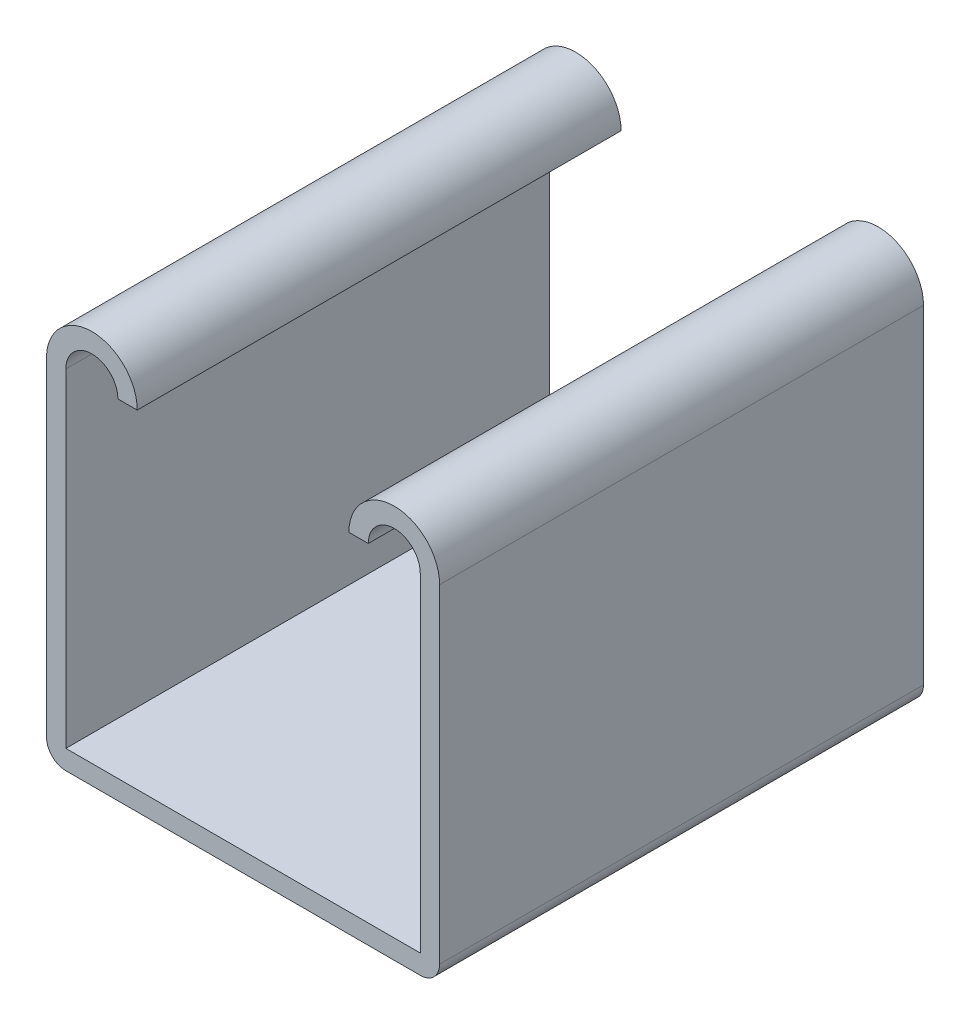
ISO-10303-21;
HEADER;
FILE_DESCRIPTION(('STEP AP214'),'2;1');
FILE_NAME('part.step','',(''),(''),'','','');
FILE_SCHEMA(('AUTOMOTIVE_DESIGN { 1 0 10303 214 1 1 1 1 }'));
ENDSEC;
DATA;
#1=APPLICATION_CONTEXT('core data for automotive mechanical design processes');
#2=APPLICATION_PROTOCOL_DEFINITION('international standard','automotive_design',2000,#1);
#3=PRODUCT_CONTEXT('',#1,'mechanical');
#4=PRODUCT('Part','Part','',(#3));
#5=PRODUCT_RELATED_PRODUCT_CATEGORY('part','',(#4));
#6=PRODUCT_DEFINITION_FORMATION('','',#4);
#7=PRODUCT_DEFINITION_CONTEXT('part definition',#1,'design');
#8=PRODUCT_DEFINITION('design','',#6,#7);
#9=PRODUCT_DEFINITION_SHAPE('','',#8);
#10=(LENGTH_UNIT() NAMED_UNIT(*) SI_UNIT(.MILLI.,.METRE.));
#11=(NAMED_UNIT(*) PLANE_ANGLE_UNIT() SI_UNIT($,.RADIAN.));
#12=(NAMED_UNIT(*) SI_UNIT($,.STERADIAN.) SOLID_ANGLE_UNIT());
#13=UNCERTAINTY_MEASURE_WITH_UNIT(LENGTH_MEASURE(1.E-05),#10,'distance_accuracy_value','');
#14=(GEOMETRIC_REPRESENTATION_CONTEXT(3) GLOBAL_UNCERTAINTY_ASSIGNED_CONTEXT((#13)) GLOBAL_UNIT_ASSIGNED_CONTEXT((#10,
#11,#12)) REPRESENTATION_CONTEXT('',''));
#15=CARTESIAN_POINT('',(0.,0.,0.));
#16=DIRECTION('',(0.,0.,1.));
#17=DIRECTION('',(1.,0.,0.));
#18=AXIS2_PLACEMENT_3D('',#15,#16,#17);
#19=CARTESIAN_POINT('',(-7.9375,9.37895,12.7));
#20=DIRECTION('',(0.,0.,-1.));
#21=DIRECTION('',(-1.,0.,0.));
#22=AXIS2_PLACEMENT_3D('',#19,#20,#21);
#23=CYLINDRICAL_SURFACE('',#22,2.38125);
#24=CARTESIAN_POINT('',(-7.9375,9.37895,-12.7));
#25=DIRECTION('',(0.,0.,1.));
#26=DIRECTION('',(-1.,0.,0.));
#27=AXIS2_PLACEMENT_3D('',#24,#25,#26);
#28=CIRCLE('',#27,2.38125);
#29=CARTESIAN_POINT('',(-5.55625,9.37895,-12.7));
#30=VERTEX_POINT('',#29);
#31=CARTESIAN_POINT('',(-10.31875,9.37895,-12.7));
#32=VERTEX_POINT('',#31);
#33=EDGE_CURVE('E164',#30,#32,#28,.T.);
#34=ORIENTED_EDGE('',*,*,#33,.T.);
#35=DIRECTION('',(0.,0.,-1.));
#36=VECTOR('',#35,1.);
#37=CARTESIAN_POINT('',(-10.31875,9.37895,12.7));
#38=LINE('',#37,#36);
#39=CARTESIAN_POINT('',(-10.31875,9.37895,12.7));
#40=VERTEX_POINT('',#39);
#41=EDGE_CURVE('E11',#40,#32,#38,.T.);
#42=ORIENTED_EDGE('',*,*,#41,.F.);
#43=CARTESIAN_POINT('',(-7.9375,9.37895,12.7));
#44=DIRECTION('',(0.,0.,1.));
#45=DIRECTION('',(-1.,0.,0.));
#46=AXIS2_PLACEMENT_3D('',#43,#44,#45);
#47=CIRCLE('',#46,2.38125);
#48=CARTESIAN_POINT('',(-5.55625,9.37895,12.7));
#49=VERTEX_POINT('',#48);
#50=EDGE_CURVE('E190',#49,#40,#47,.T.);
#51=ORIENTED_EDGE('',*,*,#50,.F.);
#52=DIRECTION('',(0.,0.,-1.));
#53=VECTOR('',#52,1.);
#54=CARTESIAN_POINT('',(-5.55625,9.37895,12.7));
#55=LINE('',#54,#53);
#56=EDGE_CURVE('E160',#49,#30,#55,.T.);
#57=ORIENTED_EDGE('',*,*,#56,.T.);
#58=EDGE_LOOP('',(#34,#42,#51,#57));
#59=FACE_BOUND('',#58,.T.);
#60=ADVANCED_FACE('F32',(#59),#23,.T.);
#61=CARTESIAN_POINT('',(-10.31875,9.37895,12.7));
#62=DIRECTION('',(1.,0.,0.));
#63=DIRECTION('',(0.,1.,0.));
#64=AXIS2_PLACEMENT_3D('',#61,#62,#63);
#65=PLANE('',#64);
#66=DIRECTION('',(0.,-1.,0.));
#67=VECTOR('',#66,1.);
#68=CARTESIAN_POINT('',(-10.31875,9.37895,-12.7));
#69=LINE('',#68,#67);
#70=CARTESIAN_POINT('',(-10.31875,-7.874,-12.7));
#71=VERTEX_POINT('',#70);
#72=EDGE_CURVE('E167',#32,#71,#69,.T.);
#73=ORIENTED_EDGE('',*,*,#72,.T.);
#74=DIRECTION('',(0.,0.,-1.));
#75=VECTOR('',#74,1.);
#76=CARTESIAN_POINT('',(-10.31875,-7.874,12.7));
#77=LINE('',#76,#75);
#78=CARTESIAN_POINT('',(-10.31875,-7.874,12.7));
#79=VERTEX_POINT('',#78);
#80=EDGE_CURVE('E40',#79,#71,#77,.T.);
#81=ORIENTED_EDGE('',*,*,#80,.F.);
#82=DIRECTION('',(0.,-1.,0.));
#83=VECTOR('',#82,1.);
#84=CARTESIAN_POINT('',(-10.31875,9.37895,12.7));
#85=LINE('',#84,#83);
#86=EDGE_CURVE('E109',#40,#79,#85,.T.);
#87=ORIENTED_EDGE('',*,*,#86,.F.);
#88=ORIENTED_EDGE('',*,*,#41,.T.);
#89=EDGE_LOOP('',(#73,#81,#87,#88));
#90=FACE_BOUND('',#89,.T.);
#91=ADVANCED_FACE('F278',(#90),#65,.F.);
#92=CARTESIAN_POINT('',(-9.30275,-7.874,12.7));
#93=DIRECTION('',(0.,0.,-1.));
#94=DIRECTION('',(-1.,0.,0.));
#95=AXIS2_PLACEMENT_3D('',#92,#93,#94);
#96=CYLINDRICAL_SURFACE('',#95,1.016);
#97=CARTESIAN_POINT('',(-9.30275,-7.874,-12.7));
#98=DIRECTION('',(0.,0.,1.));
#99=DIRECTION('',(-1.,0.,0.));
#100=AXIS2_PLACEMENT_3D('',#97,#98,#99);
#101=CIRCLE('',#100,1.016);
#102=CARTESIAN_POINT('',(-9.30275,-8.89,-12.7));
#103=VERTEX_POINT('',#102);
#104=EDGE_CURVE('E169',#71,#103,#101,.T.);
#105=ORIENTED_EDGE('',*,*,#104,.T.);
#106=DIRECTION('',(0.,0.,-1.));
#107=VECTOR('',#106,1.);
#108=CARTESIAN_POINT('',(-9.30275,-8.89,12.7));
#109=LINE('',#108,#107);
#110=CARTESIAN_POINT('',(-9.30275,-8.89,12.7));
#111=VERTEX_POINT('',#110);
#112=EDGE_CURVE('E215',#111,#103,#109,.T.);
#113=ORIENTED_EDGE('',*,*,#112,.F.);
#114=CARTESIAN_POINT('',(-9.30275,-7.874,12.7));
#115=DIRECTION('',(0.,0.,1.));
#116=DIRECTION('',(-1.,0.,0.));
#117=AXIS2_PLACEMENT_3D('',#114,#115,#116);
#118=CIRCLE('',#117,1.016);
#119=EDGE_CURVE('E223',#79,#111,#118,.T.);
#120=ORIENTED_EDGE('',*,*,#119,.F.);
#121=ORIENTED_EDGE('',*,*,#80,.T.);
#122=EDGE_LOOP('',(#105,#113,#120,#121));
#123=FACE_BOUND('',#122,.T.);
#124=ADVANCED_FACE('F221',(#123),#96,.T.);
#125=CARTESIAN_POINT('',(-9.30275,-8.89,12.7));
#126=DIRECTION('',(0.,1.,0.));
#127=DIRECTION('',(0.,0.,1.));
#128=AXIS2_PLACEMENT_3D('',#125,#126,#127);
#129=PLANE('',#128);
#130=DIRECTION('',(1.,0.,0.));
#131=VECTOR('',#130,1.);
#132=CARTESIAN_POINT('',(-9.30275,-8.89,-12.7));
#133=LINE('',#132,#131);
#134=CARTESIAN_POINT('',(9.30275,-8.89,-12.7));
#135=VERTEX_POINT('',#134);
#136=EDGE_CURVE('E171',#103,#135,#133,.T.);
#137=ORIENTED_EDGE('',*,*,#136,.T.);
#138=DIRECTION('',(0.,0.,-1.));
#139=VECTOR('',#138,1.);
#140=CARTESIAN_POINT('',(9.30275,-8.89,12.7));
#141=LINE('',#140,#139);
#142=CARTESIAN_POINT('',(9.30275,-8.89,12.7));
#143=VERTEX_POINT('',#142);
#144=EDGE_CURVE('E212',#143,#135,#141,.T.);
#145=ORIENTED_EDGE('',*,*,#144,.F.);
#146=DIRECTION('',(1.,0.,0.));
#147=VECTOR('',#146,1.);
#148=CARTESIAN_POINT('',(-9.30275,-8.89,12.7));
#149=LINE('',#148,#147);
#150=EDGE_CURVE('E241',#111,#143,#149,.T.);
#151=ORIENTED_EDGE('',*,*,#150,.F.);
#152=ORIENTED_EDGE('',*,*,#112,.T.);
#153=EDGE_LOOP('',(#137,#145,#151,#152));
#154=FACE_BOUND('',#153,.T.);
#155=ADVANCED_FACE('F232',(#154),#129,.F.);
#156=CARTESIAN_POINT('',(9.30275,-7.874,12.7));
#157=DIRECTION('',(0.,0.,-1.));
#158=DIRECTION('',(-1.,0.,0.));
#159=AXIS2_PLACEMENT_3D('',#156,#157,#158);
#160=CYLINDRICAL_SURFACE('',#159,1.016);
#161=CARTESIAN_POINT('',(9.30275,-7.874,-12.7));
#162=DIRECTION('',(0.,0.,1.));
#163=DIRECTION('',(1.,0.,0.));
#164=AXIS2_PLACEMENT_3D('',#161,#162,#163);
#165=CIRCLE('',#164,1.016);
#166=CARTESIAN_POINT('',(10.31875,-7.874,-12.7));
#167=VERTEX_POINT('',#166);
#168=EDGE_CURVE('E173',#135,#167,#165,.T.);
#169=ORIENTED_EDGE('',*,*,#168,.T.);
#170=DIRECTION('',(0.,0.,-1.));
#171=VECTOR('',#170,1.);
#172=CARTESIAN_POINT('',(10.31875,-7.874,12.7));
#173=LINE('',#172,#171);
#174=CARTESIAN_POINT('',(10.31875,-7.874,12.7));
#175=VERTEX_POINT('',#174);
#176=EDGE_CURVE('E209',#175,#167,#173,.T.);
#177=ORIENTED_EDGE('',*,*,#176,.F.);
#178=CARTESIAN_POINT('',(9.30275,-7.874,12.7));
#179=DIRECTION('',(0.,0.,1.));
#180=DIRECTION('',(1.,0.,0.));
#181=AXIS2_PLACEMENT_3D('',#178,#179,#180);
#182=CIRCLE('',#181,1.016);
#183=EDGE_CURVE('E238',#143,#175,#182,.T.);
#184=ORIENTED_EDGE('',*,*,#183,.F.);
#185=ORIENTED_EDGE('',*,*,#144,.T.);
#186=EDGE_LOOP('',(#169,#177,#184,#185));
#187=FACE_BOUND('',#186,.T.);
#188=ADVANCED_FACE('F236',(#187),#160,.T.);
#189=CARTESIAN_POINT('',(10.31875,-7.874,12.7));
#190=DIRECTION('',(-1.,0.,0.));
#191=DIRECTION('',(0.,0.,1.));
#192=AXIS2_PLACEMENT_3D('',#189,#190,#191);
#193=PLANE('',#192);
#194=DIRECTION('',(0.,1.,0.));
#195=VECTOR('',#194,1.);
#196=CARTESIAN_POINT('',(10.31875,-7.874,-12.7));
#197=LINE('',#196,#195);
#198=CARTESIAN_POINT('',(10.31875,9.37895,-12.7));
#199=VERTEX_POINT('',#198);
#200=EDGE_CURVE('E175',#167,#199,#197,.T.);
#201=ORIENTED_EDGE('',*,*,#200,.T.);
#202=DIRECTION('',(0.,0.,-1.));
#203=VECTOR('',#202,1.);
#204=CARTESIAN_POINT('',(10.31875,9.37895,12.7));
#205=LINE('',#204,#203);
#206=CARTESIAN_POINT('',(10.31875,9.37895,12.7));
#207=VERTEX_POINT('',#206);
#208=EDGE_CURVE('E206',#207,#199,#205,.T.);
#209=ORIENTED_EDGE('',*,*,#208,.F.);
#210=DIRECTION('',(0.,1.,0.));
#211=VECTOR('',#210,1.);
#212=CARTESIAN_POINT('',(10.31875,-7.874,12.7));
#213=LINE('',#212,#211);
#214=EDGE_CURVE('E240',#175,#207,#213,.T.);
#215=ORIENTED_EDGE('',*,*,#214,.F.);
#216=ORIENTED_EDGE('',*,*,#176,.T.);
#217=EDGE_LOOP('',(#201,#209,#215,#216));
#218=FACE_BOUND('',#217,.T.);
#219=ADVANCED_FACE('F291',(#218),#193,.F.);
#220=CARTESIAN_POINT('',(7.9375,9.37895,12.7));
#221=DIRECTION('',(0.,0.,-1.));
#222=DIRECTION('',(-1.,0.,0.));
#223=AXIS2_PLACEMENT_3D('',#220,#221,#222);
#224=CYLINDRICAL_SURFACE('',#223,2.38125);
#225=CARTESIAN_POINT('',(7.9375,9.37895,-12.7));
#226=DIRECTION('',(0.,0.,1.));
#227=DIRECTION('',(1.,0.,0.));
#228=AXIS2_PLACEMENT_3D('',#225,#226,#227);
#229=CIRCLE('',#228,2.38125);
#230=CARTESIAN_POINT('',(5.55625,9.37895,-12.7));
#231=VERTEX_POINT('',#230);
#232=EDGE_CURVE('E177',#199,#231,#229,.T.);
#233=ORIENTED_EDGE('',*,*,#232,.T.);
#234=DIRECTION('',(0.,0.,-1.));
#235=VECTOR('',#234,1.);
#236=CARTESIAN_POINT('',(5.55625,9.37895,12.7));
#237=LINE('',#236,#235);
#238=CARTESIAN_POINT('',(5.55625,9.37895,12.7));
#239=VERTEX_POINT('',#238);
#240=EDGE_CURVE('E203',#239,#231,#237,.T.);
#241=ORIENTED_EDGE('',*,*,#240,.F.);
#242=CARTESIAN_POINT('',(7.9375,9.37895,12.7));
#243=DIRECTION('',(0.,0.,1.));
#244=DIRECTION('',(1.,0.,0.));
#245=AXIS2_PLACEMENT_3D('',#242,#243,#244);
#246=CIRCLE('',#245,2.38125);
#247=EDGE_CURVE('E243',#207,#239,#246,.T.);
#248=ORIENTED_EDGE('',*,*,#247,.F.);
#249=ORIENTED_EDGE('',*,*,#208,.T.);
#250=EDGE_LOOP('',(#233,#241,#248,#249));
#251=FACE_BOUND('',#250,.T.);
#252=ADVANCED_FACE('F294',(#251),#224,.T.);
#253=CARTESIAN_POINT('',(5.55625,9.37895,12.7));
#254=DIRECTION('',(0.,1.,0.));
#255=DIRECTION('',(0.,0.,1.));
#256=AXIS2_PLACEMENT_3D('',#253,#254,#255);
#257=PLANE('',#256);
#258=DIRECTION('',(1.,0.,0.));
#259=VECTOR('',#258,1.);
#260=CARTESIAN_POINT('',(5.55625,9.37895,-12.7));
#261=LINE('',#260,#259);
#262=CARTESIAN_POINT('',(6.57225,9.37895,-12.7));
#263=VERTEX_POINT('',#262);
#264=EDGE_CURVE('E179',#231,#263,#261,.T.);
#265=ORIENTED_EDGE('',*,*,#264,.T.);
#266=DIRECTION('',(0.,0.,-1.));
#267=VECTOR('',#266,1.);
#268=CARTESIAN_POINT('',(6.57225,9.37895,12.7));
#269=LINE('',#268,#267);
#270=CARTESIAN_POINT('',(6.57225,9.37895,12.7));
#271=VERTEX_POINT('',#270);
#272=EDGE_CURVE('E200',#271,#263,#269,.T.);
#273=ORIENTED_EDGE('',*,*,#272,.F.);
#274=DIRECTION('',(1.,0.,0.));
#275=VECTOR('',#274,1.);
#276=CARTESIAN_POINT('',(5.55625,9.37895,12.7));
#277=LINE('',#276,#275);
#278=EDGE_CURVE('E249',#239,#271,#277,.T.);
#279=ORIENTED_EDGE('',*,*,#278,.F.);
#280=ORIENTED_EDGE('',*,*,#240,.T.);
#281=EDGE_LOOP('',(#265,#273,#279,#280));
#282=FACE_BOUND('',#281,.T.);
#283=ADVANCED_FACE('F298',(#282),#257,.F.);
#284=CARTESIAN_POINT('',(7.9375,9.37895,12.7));
#285=DIRECTION('',(0.,0.,-1.));
#286=DIRECTION('',(-1.,0.,0.));
#287=AXIS2_PLACEMENT_3D('',#284,#285,#286);
#288=CYLINDRICAL_SURFACE('',#287,1.36525);
#289=CARTESIAN_POINT('',(7.9375,9.37895,-12.7));
#290=DIRECTION('',(0.,0.,-1.));
#291=DIRECTION('',(1.,0.,0.));
#292=AXIS2_PLACEMENT_3D('',#289,#290,#291);
#293=CIRCLE('',#292,1.36525);
#294=CARTESIAN_POINT('',(9.30275,9.37895,-12.7));
#295=VERTEX_POINT('',#294);
#296=EDGE_CURVE('E181',#263,#295,#293,.T.);
#297=ORIENTED_EDGE('',*,*,#296,.T.);
#298=DIRECTION('',(0.,0.,-1.));
#299=VECTOR('',#298,1.);
#300=CARTESIAN_POINT('',(9.30275,9.37895,12.7));
#301=LINE('',#300,#299);
#302=CARTESIAN_POINT('',(9.30275,9.37895,12.7));
#303=VERTEX_POINT('',#302);
#304=EDGE_CURVE('E197',#303,#295,#301,.T.);
#305=ORIENTED_EDGE('',*,*,#304,.F.);
#306=CARTESIAN_POINT('',(7.9375,9.37895,12.7));
#307=DIRECTION('',(0.,0.,-1.));
#308=DIRECTION('',(1.,0.,0.));
#309=AXIS2_PLACEMENT_3D('',#306,#307,#308);
#310=CIRCLE('',#309,1.36525);
#311=EDGE_CURVE('E251',#271,#303,#310,.T.);
#312=ORIENTED_EDGE('',*,*,#311,.F.);
#313=ORIENTED_EDGE('',*,*,#272,.T.);
#314=EDGE_LOOP('',(#297,#305,#312,#313));
#315=FACE_BOUND('',#314,.T.);
#316=ADVANCED_FACE('F302',(#315),#288,.F.);
#317=CARTESIAN_POINT('',(9.30275,-7.874,12.7));
#318=DIRECTION('',(1.,0.,0.));
#319=DIRECTION('',(0.,0.,-1.));
#320=AXIS2_PLACEMENT_3D('',#317,#318,#319);
#321=PLANE('',#320);
#322=DIRECTION('',(0.,-1.,0.));
#323=VECTOR('',#322,1.);
#324=CARTESIAN_POINT('',(9.30275,-7.874,-12.7));
#325=LINE('',#324,#323);
#326=CARTESIAN_POINT('',(9.30275,-7.874,-12.7));
#327=VERTEX_POINT('',#326);
#328=EDGE_CURVE('E183',#295,#327,#325,.T.);
#329=ORIENTED_EDGE('',*,*,#328,.T.);
#330=DIRECTION('',(0.,0.,-1.));
#331=VECTOR('',#330,1.);
#332=CARTESIAN_POINT('',(9.30275,-7.874,12.7));
#333=LINE('',#332,#331);
#334=CARTESIAN_POINT('',(9.30275,-7.874,12.7));
#335=VERTEX_POINT('',#334);
#336=EDGE_CURVE('E194',#335,#327,#333,.T.);
#337=ORIENTED_EDGE('',*,*,#336,.F.);
#338=DIRECTION('',(0.,-1.,0.));
#339=VECTOR('',#338,1.);
#340=CARTESIAN_POINT('',(9.30275,-7.874,12.7));
#341=LINE('',#340,#339);
#342=EDGE_CURVE('E253',#303,#335,#341,.T.);
#343=ORIENTED_EDGE('',*,*,#342,.F.);
#344=ORIENTED_EDGE('',*,*,#304,.T.);
#345=EDGE_LOOP('',(#329,#337,#343,#344));
#346=FACE_BOUND('',#345,.T.);
#347=ADVANCED_FACE('F259',(#346),#321,.F.);
#348=CARTESIAN_POINT('',(-9.30275,-7.874,12.7));
#349=DIRECTION('',(0.,-1.,0.));
#350=DIRECTION('',(0.,0.,-1.));
#351=AXIS2_PLACEMENT_3D('',#348,#349,#350);
#352=PLANE('',#351);
#353=DIRECTION('',(-1.,0.,0.));
#354=VECTOR('',#353,1.);
#355=CARTESIAN_POINT('',(-9.30275,-7.874,-12.7));
#356=LINE('',#355,#354);
#357=CARTESIAN_POINT('',(-9.30275,-7.874,-12.7));
#358=VERTEX_POINT('',#357);
#359=EDGE_CURVE('E185',#327,#358,#356,.T.);
#360=ORIENTED_EDGE('',*,*,#359,.T.);
#361=DIRECTION('',(0.,0.,-1.));
#362=VECTOR('',#361,1.);
#363=CARTESIAN_POINT('',(-9.30275,-7.874,12.7));
#364=LINE('',#363,#362);
#365=CARTESIAN_POINT('',(-9.30275,-7.874,12.7));
#366=VERTEX_POINT('',#365);
#367=EDGE_CURVE('E155',#366,#358,#364,.T.);
#368=ORIENTED_EDGE('',*,*,#367,.F.);
#369=DIRECTION('',(-1.,0.,0.));
#370=VECTOR('',#369,1.);
#371=CARTESIAN_POINT('',(-9.30275,-7.874,12.7));
#372=LINE('',#371,#370);
#373=EDGE_CURVE('E146',#335,#366,#372,.T.);
#374=ORIENTED_EDGE('',*,*,#373,.F.);
#375=ORIENTED_EDGE('',*,*,#336,.T.);
#376=EDGE_LOOP('',(#360,#368,#374,#375));
#377=FACE_BOUND('',#376,.T.);
#378=ADVANCED_FACE('F263',(#377),#352,.F.);
#379=CARTESIAN_POINT('',(-9.30275,9.37895,12.7));
#380=DIRECTION('',(-1.,0.,0.));
#381=DIRECTION('',(0.,-1.,0.));
#382=AXIS2_PLACEMENT_3D('',#379,#380,#381);
#383=PLANE('',#382);
#384=DIRECTION('',(0.,1.,0.));
#385=VECTOR('',#384,1.);
#386=CARTESIAN_POINT('',(-9.30275,9.37895,-12.7));
#387=LINE('',#386,#385);
#388=CARTESIAN_POINT('',(-9.30275,9.37895,-12.7));
#389=VERTEX_POINT('',#388);
#390=EDGE_CURVE('E154',#358,#389,#387,.T.);
#391=ORIENTED_EDGE('',*,*,#390,.T.);
#392=DIRECTION('',(0.,0.,-1.));
#393=VECTOR('',#392,1.);
#394=CARTESIAN_POINT('',(-9.30275,9.37895,12.7));
#395=LINE('',#394,#393);
#396=CARTESIAN_POINT('',(-9.30275,9.37895,12.7));
#397=VERTEX_POINT('',#396);
#398=EDGE_CURVE('E151',#397,#389,#395,.T.);
#399=ORIENTED_EDGE('',*,*,#398,.F.);
#400=DIRECTION('',(0.,1.,0.));
#401=VECTOR('',#400,1.);
#402=CARTESIAN_POINT('',(-9.30275,9.37895,12.7));
#403=LINE('',#402,#401);
#404=EDGE_CURVE('E140',#366,#397,#403,.T.);
#405=ORIENTED_EDGE('',*,*,#404,.F.);
#406=ORIENTED_EDGE('',*,*,#367,.T.);
#407=EDGE_LOOP('',(#391,#399,#405,#406));
#408=FACE_BOUND('',#407,.T.);
#409=ADVANCED_FACE('F152',(#408),#383,.F.);
#410=CARTESIAN_POINT('',(-7.9375,9.37895,12.7));
#411=DIRECTION('',(0.,0.,-1.));
#412=DIRECTION('',(-1.,0.,0.));
#413=AXIS2_PLACEMENT_3D('',#410,#411,#412);
#414=CYLINDRICAL_SURFACE('',#413,1.36525);
#415=CARTESIAN_POINT('',(-7.9375,9.37895,-12.7));
#416=DIRECTION('',(0.,0.,-1.));
#417=DIRECTION('',(-1.,0.,0.));
#418=AXIS2_PLACEMENT_3D('',#415,#416,#417);
#419=CIRCLE('',#418,1.36525);
#420=CARTESIAN_POINT('',(-6.57225,9.37895,-12.7));
#421=VERTEX_POINT('',#420);
#422=EDGE_CURVE('E95',#389,#421,#419,.T.);
#423=ORIENTED_EDGE('',*,*,#422,.T.);
#424=DIRECTION('',(0.,0.,-1.));
#425=VECTOR('',#424,1.);
#426=CARTESIAN_POINT('',(-6.57225,9.37895,12.7));
#427=LINE('',#426,#425);
#428=CARTESIAN_POINT('',(-6.57225,9.37895,12.7));
#429=VERTEX_POINT('',#428);
#430=EDGE_CURVE('E156',#429,#421,#427,.T.);
#431=ORIENTED_EDGE('',*,*,#430,.F.);
#432=CARTESIAN_POINT('',(-7.9375,9.37895,12.7));
#433=DIRECTION('',(0.,0.,-1.));
#434=DIRECTION('',(-1.,0.,0.));
#435=AXIS2_PLACEMENT_3D('',#432,#433,#434);
#436=CIRCLE('',#435,1.36525);
#437=EDGE_CURVE('E144',#397,#429,#436,.T.);
#438=ORIENTED_EDGE('',*,*,#437,.F.);
#439=ORIENTED_EDGE('',*,*,#398,.T.);
#440=EDGE_LOOP('',(#423,#431,#438,#439));
#441=FACE_BOUND('',#440,.T.);
#442=ADVANCED_FACE('F158',(#441),#414,.F.);
#443=CARTESIAN_POINT('',(-6.57225,9.37895,12.7));
#444=DIRECTION('',(0.,1.,0.));
#445=DIRECTION('',(0.,0.,1.));
#446=AXIS2_PLACEMENT_3D('',#443,#444,#445);
#447=PLANE('',#446);
#448=DIRECTION('',(1.,0.,0.));
#449=VECTOR('',#448,1.);
#450=CARTESIAN_POINT('',(-6.57225,9.37895,-12.7));
#451=LINE('',#450,#449);
#452=EDGE_CURVE('E101',#421,#30,#451,.T.);
#453=ORIENTED_EDGE('',*,*,#452,.T.);
#454=ORIENTED_EDGE('',*,*,#56,.F.);
#455=DIRECTION('',(1.,0.,0.));
#456=VECTOR('',#455,1.);
#457=CARTESIAN_POINT('',(-6.57225,9.37895,12.7));
#458=LINE('',#457,#456);
#459=EDGE_CURVE('E48',#429,#49,#458,.T.);
#460=ORIENTED_EDGE('',*,*,#459,.F.);
#461=ORIENTED_EDGE('',*,*,#430,.T.);
#462=EDGE_LOOP('',(#453,#454,#460,#461));
#463=FACE_BOUND('',#462,.T.);
#464=ADVANCED_FACE('F267',(#463),#447,.F.);
#465=CARTESIAN_POINT('',(-7.9375,9.37895,12.7));
#466=DIRECTION('',(0.,0.,-1.));
#467=DIRECTION('',(-1.,0.,0.));
#468=AXIS2_PLACEMENT_3D('',#465,#466,#467);
#469=PLANE('',#468);
#470=ORIENTED_EDGE('',*,*,#50,.T.);
#471=ORIENTED_EDGE('',*,*,#86,.T.);
#472=ORIENTED_EDGE('',*,*,#119,.T.);
#473=ORIENTED_EDGE('',*,*,#150,.T.);
#474=ORIENTED_EDGE('',*,*,#183,.T.);
#475=ORIENTED_EDGE('',*,*,#214,.T.);
#476=ORIENTED_EDGE('',*,*,#247,.T.);
#477=ORIENTED_EDGE('',*,*,#278,.T.);
#478=ORIENTED_EDGE('',*,*,#311,.T.);
#479=ORIENTED_EDGE('',*,*,#342,.T.);
#480=ORIENTED_EDGE('',*,*,#373,.T.);
#481=ORIENTED_EDGE('',*,*,#404,.T.);
#482=ORIENTED_EDGE('',*,*,#437,.T.);
#483=ORIENTED_EDGE('',*,*,#459,.T.);
#484=EDGE_LOOP('',(#470,#471,#472,#473,#474,#475,#476,#477,#478,#479,#480,#481,#482,#483));
#485=FACE_BOUND('',#484,.T.);
#486=ADVANCED_FACE('F142',(#485),#469,.F.);
#487=CARTESIAN_POINT('',(-7.9375,9.37895,-12.7));
#488=DIRECTION('',(0.,0.,-1.));
#489=DIRECTION('',(-1.,0.,0.));
#490=AXIS2_PLACEMENT_3D('',#487,#488,#489);
#491=PLANE('',#490);
#492=ORIENTED_EDGE('',*,*,#33,.F.);
#493=ORIENTED_EDGE('',*,*,#452,.F.);
#494=ORIENTED_EDGE('',*,*,#422,.F.);
#495=ORIENTED_EDGE('',*,*,#390,.F.);
#496=ORIENTED_EDGE('',*,*,#359,.F.);
#497=ORIENTED_EDGE('',*,*,#328,.F.);
#498=ORIENTED_EDGE('',*,*,#296,.F.);
#499=ORIENTED_EDGE('',*,*,#264,.F.);
#500=ORIENTED_EDGE('',*,*,#232,.F.);
#501=ORIENTED_EDGE('',*,*,#200,.F.);
#502=ORIENTED_EDGE('',*,*,#168,.F.);
#503=ORIENTED_EDGE('',*,*,#136,.F.);
#504=ORIENTED_EDGE('',*,*,#104,.F.);
#505=ORIENTED_EDGE('',*,*,#72,.F.);
#506=EDGE_LOOP('',(#492,#493,#494,#495,#496,#497,#498,#499,#500,#501,#502,#503,#504,#505));
#507=FACE_BOUND('',#506,.T.);
#508=ADVANCED_FACE('F227',(#507),#491,.T.);
#509=CLOSED_SHELL('',(#60,#91,#124,#155,#188,#219,#252,#283,#316,#347,#378,#409,#442,#464,#486,#508));
#510=MANIFOLD_SOLID_BREP('B2',#509);
#511=ADVANCED_BREP_SHAPE_REPRESENTATION('',(#18,#510),#14);
#512=SHAPE_DEFINITION_REPRESENTATION(#9,#511);
ENDSEC;
END-ISO-10303-21;
